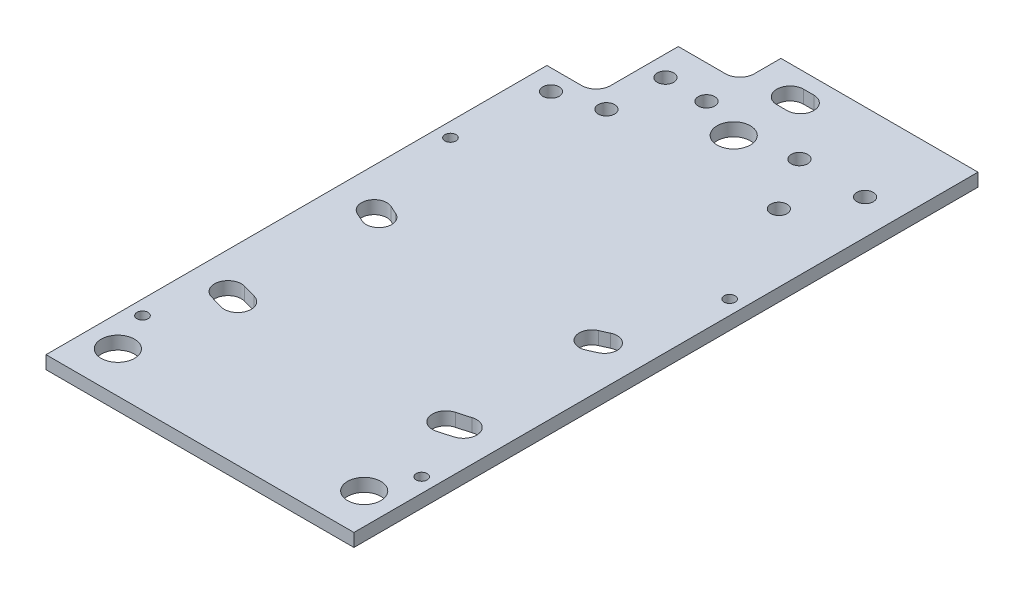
from build123d import *

# Parameters (mm, degrees)
SKETCH1_W                        = 75
SKETCH1_H                        = 152
PLATE_EXTRUDE_DEPTH              = 3.175
SKETCH4_R                        = 4.0625
KM_HOLES_DEPTH                   = 85.807609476
COLLAR_MOUNT_6_32_TAPPED_HOLE1_D = 2.7051
BOLT_HOLES_DEPTH                 = 85.807609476
KM_SPRING_HOLES_DEPTH            = 85.807609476
SPRING_SLOT_AND_HOLE_REACH       = 86.808
SKETCH19_R                       = 2
VECTRAN_HOLES_REACH              = 86.808
SKETCH20_R                       = 2
BURN_MECHANISM_REACH             = 86.808
SKETCH21_R                       = 2
FILLET1_R                        = 3.5
CUT_EXTRUDE2_REACH               = 86.808
SKETCH23_R                       = 2


with BuildPart() as part:
    # Sketch1 → Plate Extrude (new body)
    with BuildSketch(Plane(origin=(0, 0, 0), x_dir=(1, 0, 0), z_dir=(0, 1, 0))):
        Rectangle(SKETCH1_W, SKETCH1_H)
    extrude(amount=PLATE_EXTRUDE_DEPTH)

    # Sketch4 → KM Holes (cut, through all)
    with BuildSketch(Plane(origin=(0, 3.175, 0), x_dir=(1, 0, 0), z_dir=(0, 1, 0))):
        with Locations(Location((0, 54, 0), (0, 0, 270))):
            Circle(SKETCH4_R)
        with Locations(Location((30, -66, 0), (0, 0, 270))):
            Circle(SKETCH4_R)
        with Locations(Location((-30, -66, 0), (0, 0, 270))):
            Circle(SKETCH4_R)
    extrude(amount=-KM_HOLES_DEPTH, mode=Mode.SUBTRACT)

    # Collar Mount _6-32 Tapped Hole1 (through all)
    with Locations(Plane(origin=(0, 3.175, 0), x_dir=(1, 0, 0), z_dir=(0, 1, 0))):
        with Locations((-34, 19), (34, 19), (-34, -56), (34, -56)):
            Hole(COLLAR_MOUNT_6_32_TAPPED_HOLE1_D / 2)

    # Sketch7 → Bolt Holes (cut, through all)
    with BuildSketch(Plane(origin=(0, 3.175, 0), x_dir=(1, 0, 0), z_dir=(0, 1, 0))):
        with BuildLine():
            Line((-1.25, 72.26), (1.25, 72.26))
            ThreePointArc((1.25, 72.26), (4.51, 69), (1.25, 65.74))
            Line((1.25, 65.74), (-1.25, 65.74))
            ThreePointArc((-1.25, 65.74), (-4.51, 69), (-1.25, 72.26))
        make_face()
        with BuildLine():
            ThreePointArc((-29.600819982, -43.637827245), (-27.892296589, -44.139562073), (-26.175276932, -44.611402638))
            ThreePointArc((-26.175276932, -44.611402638), (-22.183252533, -42.294113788), (-24.500541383, -38.302089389))
            ThreePointArc((-24.500541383, -38.302089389), (-26.107703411, -37.860437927), (-27.70691278, -37.390804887))
            ThreePointArc((-27.70691278, -37.390804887), (-31.77737756, -39.567362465), (-29.600819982, -43.637827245))
        make_face()
        with BuildLine():
            ThreePointArc((26.175276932, -44.611402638), (27.892296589, -44.139562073), (29.600819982, -43.637827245))
            ThreePointArc((29.600819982, -43.637827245), (31.77737756, -39.567362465), (27.70691278, -37.390804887))
            ThreePointArc((27.70691278, -37.390804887), (26.107703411, -37.860437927), (24.500541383, -38.302089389))
            ThreePointArc((24.500541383, -38.302089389), (22.183252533, -42.294113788), (26.175276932, -44.611402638))
        make_face()
    extrude(amount=-BOLT_HOLES_DEPTH, mode=Mode.SUBTRACT)

    # Sketch18 → KM Spring Holes (cut, through all)
    with BuildSketch(Plane(origin=(0, 3.175, 0), x_dir=(1, 0, 0), z_dir=(0, 1, 0))):
        with BuildLine():
            ThreePointArc((-29.3643061, -8.323971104), (-28.2721305, -8.826956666), (-27.171342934, -9.310804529))
            ThreePointArc((-27.171342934, -9.310804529), (-23.100015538, -7.684676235), (-24.726143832, -3.613348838))
            ThreePointArc((-24.726143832, -3.613348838), (-25.7278695, -3.173043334), (-26.721758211, -2.715322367))
            ThreePointArc((-26.721758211, -2.715322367), (-30.847356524, -4.198372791), (-29.3643061, -8.323971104))
        make_face()
        with BuildLine():
            ThreePointArc((27.171342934, -9.310804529), (28.2721305, -8.826956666), (29.3643061, -8.323971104))
            ThreePointArc((29.3643061, -8.323971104), (30.847356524, -4.198372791), (26.721758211, -2.715322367))
            ThreePointArc((26.721758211, -2.715322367), (25.7278695, -3.173043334), (24.726143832, -3.613348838))
            ThreePointArc((24.726143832, -3.613348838), (23.100015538, -7.684676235), (27.171342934, -9.310804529))
        make_face()
    extrude(amount=-KM_SPRING_HOLES_DEPTH, mode=Mode.SUBTRACT)

    # Sketch19 → Spring Slot and Hole (cut, up to next)
    with BuildSketch(Plane(origin=(0, 3.175, 0), x_dir=(1, 0, 0), z_dir=(0, 1, 0)), mode=Mode.PRIVATE) as spring_slot_and_hole_sk1:
        with Locations(Location((-31.5, 41, 0), (0, 0, 270))):
            Circle(SKETCH19_R)
    spring_slot_and_hole_tool1 = extrude(spring_slot_and_hole_sk1.sketch, amount=-SPRING_SLOT_AND_HOLE_REACH, mode=Mode.PRIVATE) & part.part
    # Sketch19 → Spring Slot and Hole (cut, up to next)
    with BuildSketch(Plane(origin=(0, 3.175, 0), x_dir=(1, 0, 0), z_dir=(0, 1, 0)), mode=Mode.PRIVATE) as spring_slot_and_hole_sk2:
        with BuildLine():
            Line((-37.5, 76), (-25.5, 76))
            Line((-25.5, 76), (-10.5, 76))
            Line((-10.5, 76), (-10.5, 66))
            Line((-10.5, 66), (-25.5, 66))
            Line((-25.5, 66), (-25.5, 49.5))
            ThreePointArc((-25.5, 49.5), (-26.525126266, 47.025126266), (-29, 46))
            Line((-29, 46), (-34, 46))
            Line((-34, 46), (-37.5, 46))
            Line((-37.5, 46), (-37.5, 76))
        make_face()
    spring_slot_and_hole_tool2 = extrude(spring_slot_and_hole_sk2.sketch, amount=-SPRING_SLOT_AND_HOLE_REACH, mode=Mode.PRIVATE) & part.part
    add(spring_slot_and_hole_tool1.solids().sort_by_distance((-31.5, 3.175, -41))[0], mode=Mode.SUBTRACT)
    add(spring_slot_and_hole_tool2.solids().sort_by_distance((-27.535876, 3.175, -64.030085))[0], mode=Mode.SUBTRACT)

    # Sketch20 → Vectran Holes (cut, up to next)
    with BuildSketch(Plane(origin=(0, 3.175, 0), x_dir=(1, 0, 0), z_dir=(0, 1, 0)), mode=Mode.PRIVATE) as vectran_holes_sk1:
        with Locations(Location((-21, 44, 0), (0, 0, 270))):
            Circle(SKETCH20_R)
    vectran_holes_tool1 = extrude(vectran_holes_sk1.sketch, amount=-VECTRAN_HOLES_REACH, mode=Mode.PRIVATE) & part.part
    # Sketch20 → Vectran Holes (cut, up to next)
    with BuildSketch(Plane(origin=(0, 3.175, 0), x_dir=(1, 0, 0), z_dir=(0, 1, 0)), mode=Mode.PRIVATE) as vectran_holes_sk2:
        with Locations(Location((21, 44, 0), (0, 0, 270))):
            Circle(SKETCH20_R)
    vectran_holes_tool2 = extrude(vectran_holes_sk2.sketch, amount=-VECTRAN_HOLES_REACH, mode=Mode.PRIVATE) & part.part
    add(vectran_holes_tool1.solids().sort_by_distance((-21, 3.175, -44))[0], mode=Mode.SUBTRACT)
    add(vectran_holes_tool2.solids().sort_by_distance((21, 3.175, -44))[0], mode=Mode.SUBTRACT)

    # Sketch21 → Burn Mechanism (cut, up to next)
    with BuildSketch(Plane(origin=(0, 3.175, 0), x_dir=(1, 0, 0), z_dir=(0, 1, 0)), mode=Mode.PRIVATE) as burn_mechanism_sk1:
        with Locations(Location((29, 57, 0), (0, 0, 270))):
            Circle(SKETCH21_R)
    burn_mechanism_tool1 = extrude(burn_mechanism_sk1.sketch, amount=-BURN_MECHANISM_REACH, mode=Mode.PRIVATE) & part.part
    # Sketch21 → Burn Mechanism (cut, up to next)
    with BuildSketch(Plane(origin=(0, 3.175, 0), x_dir=(1, 0, 0), z_dir=(0, 1, 0)), mode=Mode.PRIVATE) as burn_mechanism_sk2:
        with Locations(Location((13, 57, 0), (0, 0, 270))):
            Circle(SKETCH21_R)
    burn_mechanism_tool2 = extrude(burn_mechanism_sk2.sketch, amount=-BURN_MECHANISM_REACH, mode=Mode.PRIVATE) & part.part
    add(burn_mechanism_tool1.solids().sort_by_distance((29, 3.175, -57))[0], mode=Mode.SUBTRACT)
    add(burn_mechanism_tool2.solids().sort_by_distance((13, 3.175, -57))[0], mode=Mode.SUBTRACT)

    # Fillet1
    fillet1_edges = [part.edges().sort_by_distance(p)[0] for p in [
        (-10.5, 1.5875, -66),
    ]]
    fillet(fillet1_edges, radius=FILLET1_R)

    # Sketch23 → Cut-Extrude2 (cut, up to next)
    with BuildSketch(Plane(origin=(0, 3.175, 0), x_dir=(1, 0, 0), z_dir=(0, 1, 0)), mode=Mode.PRIVATE) as cut_extrude2_sk1:
        with Locations(Location((-20.5, 57.875, 0), (0, 0, 270))):
            Circle(SKETCH23_R)
    cut_extrude2_tool1 = extrude(cut_extrude2_sk1.sketch, amount=-CUT_EXTRUDE2_REACH, mode=Mode.PRIVATE) & part.part
    # Sketch23 → Cut-Extrude2 (cut, up to next)
    with BuildSketch(Plane(origin=(0, 3.175, 0), x_dir=(1, 0, 0), z_dir=(0, 1, 0)), mode=Mode.PRIVATE) as cut_extrude2_sk2:
        with Locations(Location((-10.5, 57.875, 0), (0, 0, 270))):
            Circle(SKETCH23_R)
    cut_extrude2_tool2 = extrude(cut_extrude2_sk2.sketch, amount=-CUT_EXTRUDE2_REACH, mode=Mode.PRIVATE) & part.part
    add(cut_extrude2_tool1.solids().sort_by_distance((-20.5, 3.175, -57.875))[0], mode=Mode.SUBTRACT)
    add(cut_extrude2_tool2.solids().sort_by_distance((-10.5, 3.175, -57.875))[0], mode=Mode.SUBTRACT)


solid = part.part
